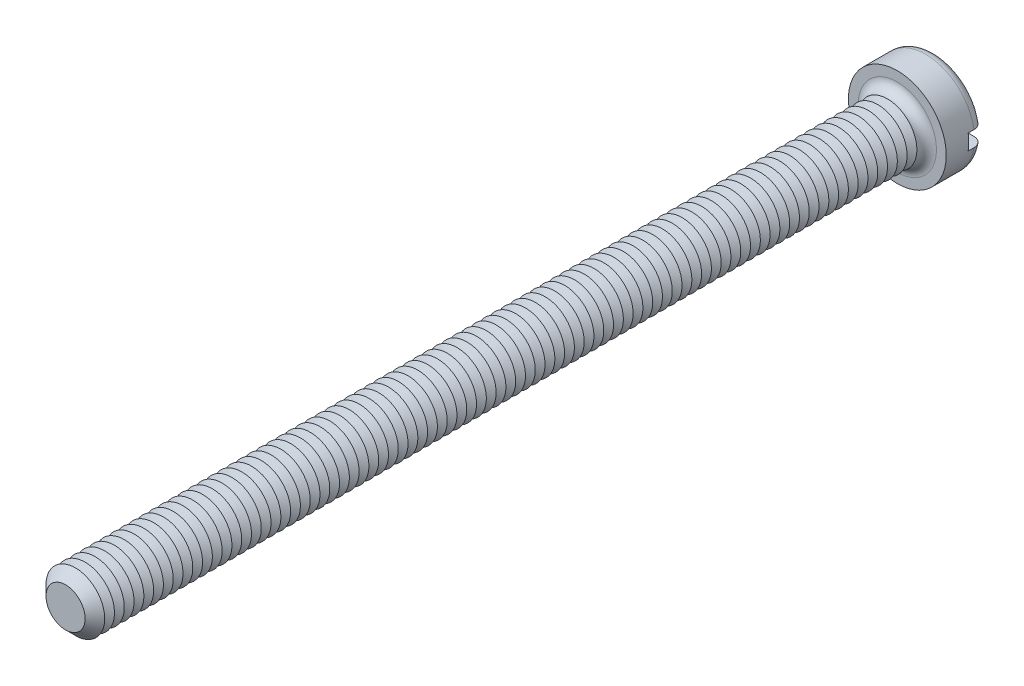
from build123d import *

# Parameters (mm, degrees)
SKETCH3_R           = 5
BOSS_EXTRUDE2_DEPTH = 3.9
SKETCH4_R           = 3
BOSS_EXTRUDE3_DEPTH = 85
FILLET1_R           = 1
CHAMFER1_SIZE       = 1
LPATTERN1_COUNT     = 83
LPATTERN1_PITCH     = 1
SKETCH8_W           = 10
SKETCH8_H           = 1.6
CUT_EXTRUDE1_DEPTH  = 1.6


with BuildPart() as part:
    # Sketch3 → Boss-Extrude2 (new body)
    with BuildSketch(Plane.XY):
        Circle(SKETCH3_R)
    extrude(amount=-BOSS_EXTRUDE2_DEPTH)

    # Sketch4 → Boss-Extrude3 (add)
    with BuildSketch(Plane.XY):
        Circle(SKETCH4_R)
    extrude(amount=BOSS_EXTRUDE3_DEPTH)

    # Fillet1
    fillet1_edges = [part.edges().sort_by_distance(p)[0] for p in [
        (-5, 0, -3.9),
        (-3, 0, 0),
    ]]
    fillet(fillet1_edges, radius=FILLET1_R)

    # Chamfer1
    chamfer1_edges = [part.edges().sort_by_distance(p)[0] for p in [
        (-3, 0, 85),
    ]]
    chamfer(chamfer1_edges, length=CHAMFER1_SIZE)

    # Sketch6 → Cut-Revolve1 (revolve, cut)
    with BuildSketch(Plane(origin=(0, 0, 0), x_dir=(0, 0, -1), z_dir=(1, 0, 0)), mode=Mode.PRIVATE) as cut_revolve1_sk:
        Polygon((-1, 3), (-1.5, 2.133974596), (-2, 3), align=None)
    cut_revolve1 = revolve(cut_revolve1_sk.sketch.rotate(Axis((0, 0, -1.694361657), (0, 0, 1)), 90), axis=Axis((0, 0, -1.694361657), (0, 0, 1)), mode=Mode.SUBTRACT)

    # LPattern1: Cut-Revolve1 ×83
    with Locations(*[(0, 0, i * LPATTERN1_PITCH) for i in range(1, LPATTERN1_COUNT)]):
        add(cut_revolve1, mode=Mode.SUBTRACT)

    # Sketch8 → Cut-Extrude1 (cut)
    with BuildSketch(Plane(origin=(0, 0, -3.9), x_dir=(-1, 0, 0), z_dir=(0, 0, -1))):
        Rectangle(SKETCH8_W, SKETCH8_H)
    extrude(amount=-CUT_EXTRUDE1_DEPTH, mode=Mode.SUBTRACT)


solid = part.part
